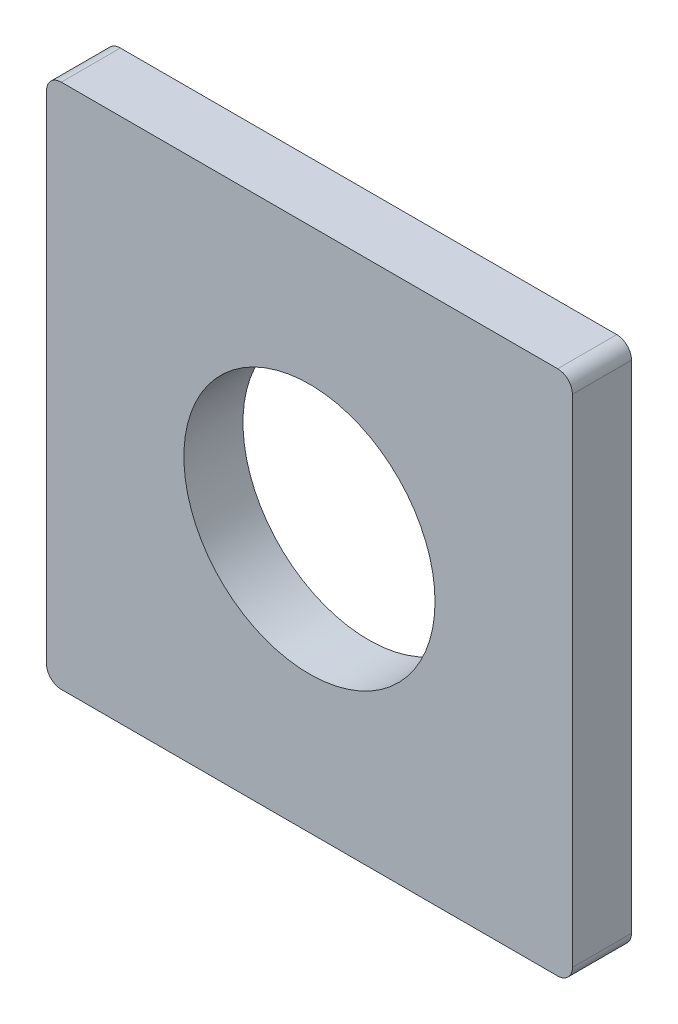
ISO-10303-21;
HEADER;
FILE_DESCRIPTION(('STEP AP214'),'2;1');
FILE_NAME('part.step','',(''),(''),'','','');
FILE_SCHEMA(('AUTOMOTIVE_DESIGN { 1 0 10303 214 1 1 1 1 }'));
ENDSEC;
DATA;
#1=APPLICATION_CONTEXT('core data for automotive mechanical design processes');
#2=APPLICATION_PROTOCOL_DEFINITION('international standard','automotive_design',2000,#1);
#3=PRODUCT_CONTEXT('',#1,'mechanical');
#4=PRODUCT('Part','Part','',(#3));
#5=PRODUCT_RELATED_PRODUCT_CATEGORY('part','',(#4));
#6=PRODUCT_DEFINITION_FORMATION('','',#4);
#7=PRODUCT_DEFINITION_CONTEXT('part definition',#1,'design');
#8=PRODUCT_DEFINITION('design','',#6,#7);
#9=PRODUCT_DEFINITION_SHAPE('','',#8);
#10=(LENGTH_UNIT() NAMED_UNIT(*) SI_UNIT(.MILLI.,.METRE.));
#11=(NAMED_UNIT(*) PLANE_ANGLE_UNIT() SI_UNIT($,.RADIAN.));
#12=(NAMED_UNIT(*) SI_UNIT($,.STERADIAN.) SOLID_ANGLE_UNIT());
#13=UNCERTAINTY_MEASURE_WITH_UNIT(LENGTH_MEASURE(1.E-05),#10,'distance_accuracy_value','');
#14=(GEOMETRIC_REPRESENTATION_CONTEXT(3) GLOBAL_UNCERTAINTY_ASSIGNED_CONTEXT((#13)) GLOBAL_UNIT_ASSIGNED_CONTEXT((#10,
#11,#12)) REPRESENTATION_CONTEXT('',''));
#15=CARTESIAN_POINT('',(0.,0.,0.));
#16=DIRECTION('',(0.,0.,1.));
#17=DIRECTION('',(1.,0.,0.));
#18=AXIS2_PLACEMENT_3D('',#15,#16,#17);
#19=CARTESIAN_POINT('',(0.5,0.5,2.));
#20=DIRECTION('',(0.,0.,1.));
#21=DIRECTION('',(1.,0.,0.));
#22=AXIS2_PLACEMENT_3D('',#19,#20,#21);
#23=PLANE('',#22);
#24=CARTESIAN_POINT('',(0.5,0.5,2.));
#25=DIRECTION('',(0.,0.,1.));
#26=DIRECTION('',(1.,0.,0.));
#27=AXIS2_PLACEMENT_3D('',#24,#25,#26);
#28=CIRCLE('',#27,0.5);
#29=CARTESIAN_POINT('',(0.,0.500000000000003,2.));
#30=VERTEX_POINT('',#29);
#31=CARTESIAN_POINT('',(0.500000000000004,0.,2.));
#32=VERTEX_POINT('',#31);
#33=EDGE_CURVE('E153',#30,#32,#28,.T.);
#34=ORIENTED_EDGE('',*,*,#33,.T.);
#35=DIRECTION('',(1.,0.,0.));
#36=VECTOR('',#35,1.);
#37=CARTESIAN_POINT('',(0.500000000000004,0.,2.));
#38=LINE('',#37,#36);
#39=CARTESIAN_POINT('',(17.3,0.,2.));
#40=VERTEX_POINT('',#39);
#41=EDGE_CURVE('E101',#32,#40,#38,.T.);
#42=ORIENTED_EDGE('',*,*,#41,.T.);
#43=CARTESIAN_POINT('',(17.3,0.5,2.));
#44=DIRECTION('',(0.,0.,1.));
#45=DIRECTION('',(1.,0.,0.));
#46=AXIS2_PLACEMENT_3D('',#43,#44,#45);
#47=CIRCLE('',#46,0.5);
#48=CARTESIAN_POINT('',(17.8,0.5,2.));
#49=VERTEX_POINT('',#48);
#50=EDGE_CURVE('E168',#40,#49,#47,.T.);
#51=ORIENTED_EDGE('',*,*,#50,.T.);
#52=DIRECTION('',(0.,1.,0.));
#53=VECTOR('',#52,1.);
#54=CARTESIAN_POINT('',(17.8,0.5,2.));
#55=LINE('',#54,#53);
#56=CARTESIAN_POINT('',(17.8,17.3,2.));
#57=VERTEX_POINT('',#56);
#58=EDGE_CURVE('E181',#49,#57,#55,.T.);
#59=ORIENTED_EDGE('',*,*,#58,.T.);
#60=CARTESIAN_POINT('',(17.3,17.3,2.));
#61=DIRECTION('',(0.,0.,1.));
#62=DIRECTION('',(1.,0.,0.));
#63=AXIS2_PLACEMENT_3D('',#60,#61,#62);
#64=CIRCLE('',#63,0.500000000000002);
#65=CARTESIAN_POINT('',(17.3,17.8,2.));
#66=VERTEX_POINT('',#65);
#67=EDGE_CURVE('E120',#57,#66,#64,.T.);
#68=ORIENTED_EDGE('',*,*,#67,.T.);
#69=DIRECTION('',(-1.,0.,0.));
#70=VECTOR('',#69,1.);
#71=CARTESIAN_POINT('',(0.5,17.8,2.));
#72=LINE('',#71,#70);
#73=CARTESIAN_POINT('',(0.5,17.8,2.));
#74=VERTEX_POINT('',#73);
#75=EDGE_CURVE('E114',#66,#74,#72,.T.);
#76=ORIENTED_EDGE('',*,*,#75,.T.);
#77=CARTESIAN_POINT('',(0.5,17.3,2.));
#78=DIRECTION('',(0.,0.,1.));
#79=DIRECTION('',(1.,0.,0.));
#80=AXIS2_PLACEMENT_3D('',#77,#78,#79);
#81=CIRCLE('',#80,0.5);
#82=CARTESIAN_POINT('',(0.,17.3,2.));
#83=VERTEX_POINT('',#82);
#84=EDGE_CURVE('E118',#74,#83,#81,.T.);
#85=ORIENTED_EDGE('',*,*,#84,.T.);
#86=DIRECTION('',(0.,-1.,0.));
#87=VECTOR('',#86,1.);
#88=CARTESIAN_POINT('',(0.,0.500000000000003,2.));
#89=LINE('',#88,#87);
#90=EDGE_CURVE('E58',#83,#30,#89,.T.);
#91=ORIENTED_EDGE('',*,*,#90,.T.);
#92=EDGE_LOOP('',(#34,#42,#51,#59,#68,#76,#85,#91));
#93=FACE_BOUND('',#92,.T.);
#94=CARTESIAN_POINT('',(8.9,8.9,2.));
#95=DIRECTION('',(0.,0.,1.));
#96=DIRECTION('',(1.,0.,0.));
#97=AXIS2_PLACEMENT_3D('',#94,#95,#96);
#98=CIRCLE('',#97,4.25);
#99=CARTESIAN_POINT('',(13.15,8.9,2.));
#100=VERTEX_POINT('',#99);
#101=EDGE_CURVE('E142',#100,#100,#98,.T.);
#102=ORIENTED_EDGE('',*,*,#101,.F.);
#103=EDGE_LOOP('',(#102));
#104=FACE_BOUND('',#103,.T.);
#105=ADVANCED_FACE('F41',(#93,#104),#23,.T.);
#106=CARTESIAN_POINT('',(0.5,0.5,0.));
#107=DIRECTION('',(0.,0.,1.));
#108=DIRECTION('',(1.,0.,0.));
#109=AXIS2_PLACEMENT_3D('',#106,#107,#108);
#110=PLANE('',#109);
#111=CARTESIAN_POINT('',(0.5,0.5,0.));
#112=DIRECTION('',(0.,0.,1.));
#113=DIRECTION('',(1.,0.,0.));
#114=AXIS2_PLACEMENT_3D('',#111,#112,#113);
#115=CIRCLE('',#114,0.5);
#116=CARTESIAN_POINT('',(0.,0.500000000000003,0.));
#117=VERTEX_POINT('',#116);
#118=CARTESIAN_POINT('',(0.500000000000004,0.,0.));
#119=VERTEX_POINT('',#118);
#120=EDGE_CURVE('E138',#117,#119,#115,.T.);
#121=ORIENTED_EDGE('',*,*,#120,.F.);
#122=DIRECTION('',(0.,-1.,0.));
#123=VECTOR('',#122,1.);
#124=CARTESIAN_POINT('',(0.,0.500000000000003,0.));
#125=LINE('',#124,#123);
#126=CARTESIAN_POINT('',(0.,17.3,0.));
#127=VERTEX_POINT('',#126);
#128=EDGE_CURVE('E93',#127,#117,#125,.T.);
#129=ORIENTED_EDGE('',*,*,#128,.F.);
#130=CARTESIAN_POINT('',(0.5,17.3,0.));
#131=DIRECTION('',(0.,0.,1.));
#132=DIRECTION('',(1.,0.,0.));
#133=AXIS2_PLACEMENT_3D('',#130,#131,#132);
#134=CIRCLE('',#133,0.5);
#135=CARTESIAN_POINT('',(0.5,17.8,0.));
#136=VERTEX_POINT('',#135);
#137=EDGE_CURVE('E87',#136,#127,#134,.T.);
#138=ORIENTED_EDGE('',*,*,#137,.F.);
#139=DIRECTION('',(-1.,0.,0.));
#140=VECTOR('',#139,1.);
#141=CARTESIAN_POINT('',(0.5,17.8,0.));
#142=LINE('',#141,#140);
#143=CARTESIAN_POINT('',(17.3,17.8,0.));
#144=VERTEX_POINT('',#143);
#145=EDGE_CURVE('E128',#144,#136,#142,.T.);
#146=ORIENTED_EDGE('',*,*,#145,.F.);
#147=CARTESIAN_POINT('',(17.3,17.3,0.));
#148=DIRECTION('',(0.,0.,1.));
#149=DIRECTION('',(1.,0.,0.));
#150=AXIS2_PLACEMENT_3D('',#147,#148,#149);
#151=CIRCLE('',#150,0.500000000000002);
#152=CARTESIAN_POINT('',(17.8,17.3,0.));
#153=VERTEX_POINT('',#152);
#154=EDGE_CURVE('E148',#153,#144,#151,.T.);
#155=ORIENTED_EDGE('',*,*,#154,.F.);
#156=DIRECTION('',(0.,1.,0.));
#157=VECTOR('',#156,1.);
#158=CARTESIAN_POINT('',(17.8,0.5,0.));
#159=LINE('',#158,#157);
#160=CARTESIAN_POINT('',(17.8,0.5,0.));
#161=VERTEX_POINT('',#160);
#162=EDGE_CURVE('E146',#161,#153,#159,.T.);
#163=ORIENTED_EDGE('',*,*,#162,.F.);
#164=CARTESIAN_POINT('',(17.3,0.5,0.));
#165=DIRECTION('',(0.,0.,1.));
#166=DIRECTION('',(1.,0.,0.));
#167=AXIS2_PLACEMENT_3D('',#164,#165,#166);
#168=CIRCLE('',#167,0.5);
#169=CARTESIAN_POINT('',(17.3,0.,0.));
#170=VERTEX_POINT('',#169);
#171=EDGE_CURVE('E144',#170,#161,#168,.T.);
#172=ORIENTED_EDGE('',*,*,#171,.F.);
#173=DIRECTION('',(1.,0.,0.));
#174=VECTOR('',#173,1.);
#175=CARTESIAN_POINT('',(0.500000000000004,0.,0.));
#176=LINE('',#175,#174);
#177=EDGE_CURVE('E141',#119,#170,#176,.T.);
#178=ORIENTED_EDGE('',*,*,#177,.F.);
#179=EDGE_LOOP('',(#121,#129,#138,#146,#155,#163,#172,#178));
#180=FACE_BOUND('',#179,.T.);
#181=CARTESIAN_POINT('',(8.9,8.9,0.));
#182=DIRECTION('',(0.,0.,1.));
#183=DIRECTION('',(1.,0.,0.));
#184=AXIS2_PLACEMENT_3D('',#181,#182,#183);
#185=CIRCLE('',#184,4.25);
#186=CARTESIAN_POINT('',(13.15,8.9,0.));
#187=VERTEX_POINT('',#186);
#188=EDGE_CURVE('E187',#187,#187,#185,.T.);
#189=ORIENTED_EDGE('',*,*,#188,.T.);
#190=EDGE_LOOP('',(#189));
#191=FACE_BOUND('',#190,.T.);
#192=ADVANCED_FACE('F172',(#180,#191),#110,.F.);
#193=CARTESIAN_POINT('',(0.5,0.5,2.));
#194=DIRECTION('',(0.,0.,-1.));
#195=DIRECTION('',(-1.,0.,0.));
#196=AXIS2_PLACEMENT_3D('',#193,#194,#195);
#197=CYLINDRICAL_SURFACE('',#196,0.5);
#198=ORIENTED_EDGE('',*,*,#120,.T.);
#199=DIRECTION('',(0.,0.,-1.));
#200=VECTOR('',#199,1.);
#201=CARTESIAN_POINT('',(0.500000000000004,0.,2.));
#202=LINE('',#201,#200);
#203=EDGE_CURVE('E11',#32,#119,#202,.T.);
#204=ORIENTED_EDGE('',*,*,#203,.F.);
#205=ORIENTED_EDGE('',*,*,#33,.F.);
#206=DIRECTION('',(0.,0.,-1.));
#207=VECTOR('',#206,1.);
#208=CARTESIAN_POINT('',(0.,0.500000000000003,2.));
#209=LINE('',#208,#207);
#210=EDGE_CURVE('E134',#30,#117,#209,.T.);
#211=ORIENTED_EDGE('',*,*,#210,.T.);
#212=EDGE_LOOP('',(#198,#204,#205,#211));
#213=FACE_BOUND('',#212,.T.);
#214=ADVANCED_FACE('F43',(#213),#197,.T.);
#215=CARTESIAN_POINT('',(0.500000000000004,0.,2.));
#216=DIRECTION('',(0.,1.,0.));
#217=DIRECTION('',(0.,0.,1.));
#218=AXIS2_PLACEMENT_3D('',#215,#216,#217);
#219=PLANE('',#218);
#220=ORIENTED_EDGE('',*,*,#177,.T.);
#221=DIRECTION('',(0.,0.,-1.));
#222=VECTOR('',#221,1.);
#223=CARTESIAN_POINT('',(17.3,0.,2.));
#224=LINE('',#223,#222);
#225=EDGE_CURVE('E50',#40,#170,#224,.T.);
#226=ORIENTED_EDGE('',*,*,#225,.F.);
#227=ORIENTED_EDGE('',*,*,#41,.F.);
#228=ORIENTED_EDGE('',*,*,#203,.T.);
#229=EDGE_LOOP('',(#220,#226,#227,#228));
#230=FACE_BOUND('',#229,.T.);
#231=ADVANCED_FACE('F215',(#230),#219,.F.);
#232=CARTESIAN_POINT('',(17.3,0.5,2.));
#233=DIRECTION('',(0.,0.,-1.));
#234=DIRECTION('',(-1.,0.,0.));
#235=AXIS2_PLACEMENT_3D('',#232,#233,#234);
#236=CYLINDRICAL_SURFACE('',#235,0.5);
#237=ORIENTED_EDGE('',*,*,#171,.T.);
#238=DIRECTION('',(0.,0.,-1.));
#239=VECTOR('',#238,1.);
#240=CARTESIAN_POINT('',(17.8,0.5,2.));
#241=LINE('',#240,#239);
#242=EDGE_CURVE('E160',#49,#161,#241,.T.);
#243=ORIENTED_EDGE('',*,*,#242,.F.);
#244=ORIENTED_EDGE('',*,*,#50,.F.);
#245=ORIENTED_EDGE('',*,*,#225,.T.);
#246=EDGE_LOOP('',(#237,#243,#244,#245));
#247=FACE_BOUND('',#246,.T.);
#248=ADVANCED_FACE('F166',(#247),#236,.T.);
#249=CARTESIAN_POINT('',(17.8,0.5,2.));
#250=DIRECTION('',(-1.,0.,0.));
#251=DIRECTION('',(0.,0.,1.));
#252=AXIS2_PLACEMENT_3D('',#249,#250,#251);
#253=PLANE('',#252);
#254=ORIENTED_EDGE('',*,*,#162,.T.);
#255=DIRECTION('',(0.,0.,-1.));
#256=VECTOR('',#255,1.);
#257=CARTESIAN_POINT('',(17.8,17.3,2.));
#258=LINE('',#257,#256);
#259=EDGE_CURVE('E157',#57,#153,#258,.T.);
#260=ORIENTED_EDGE('',*,*,#259,.F.);
#261=ORIENTED_EDGE('',*,*,#58,.F.);
#262=ORIENTED_EDGE('',*,*,#242,.T.);
#263=EDGE_LOOP('',(#254,#260,#261,#262));
#264=FACE_BOUND('',#263,.T.);
#265=ADVANCED_FACE('F177',(#264),#253,.F.);
#266=CARTESIAN_POINT('',(17.3,17.3,2.));
#267=DIRECTION('',(0.,0.,-1.));
#268=DIRECTION('',(-1.,0.,0.));
#269=AXIS2_PLACEMENT_3D('',#266,#267,#268);
#270=CYLINDRICAL_SURFACE('',#269,0.500000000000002);
#271=ORIENTED_EDGE('',*,*,#154,.T.);
#272=DIRECTION('',(0.,0.,-1.));
#273=VECTOR('',#272,1.);
#274=CARTESIAN_POINT('',(17.3,17.8,2.));
#275=LINE('',#274,#273);
#276=EDGE_CURVE('E129',#66,#144,#275,.T.);
#277=ORIENTED_EDGE('',*,*,#276,.F.);
#278=ORIENTED_EDGE('',*,*,#67,.F.);
#279=ORIENTED_EDGE('',*,*,#259,.T.);
#280=EDGE_LOOP('',(#271,#277,#278,#279));
#281=FACE_BOUND('',#280,.T.);
#282=ADVANCED_FACE('F180',(#281),#270,.T.);
#283=CARTESIAN_POINT('',(0.5,17.8,2.));
#284=DIRECTION('',(0.,-1.,0.));
#285=DIRECTION('',(0.,0.,-1.));
#286=AXIS2_PLACEMENT_3D('',#283,#284,#285);
#287=PLANE('',#286);
#288=ORIENTED_EDGE('',*,*,#145,.T.);
#289=DIRECTION('',(0.,0.,-1.));
#290=VECTOR('',#289,1.);
#291=CARTESIAN_POINT('',(0.5,17.8,2.));
#292=LINE('',#291,#290);
#293=EDGE_CURVE('E125',#74,#136,#292,.T.);
#294=ORIENTED_EDGE('',*,*,#293,.F.);
#295=ORIENTED_EDGE('',*,*,#75,.F.);
#296=ORIENTED_EDGE('',*,*,#276,.T.);
#297=EDGE_LOOP('',(#288,#294,#295,#296));
#298=FACE_BOUND('',#297,.T.);
#299=ADVANCED_FACE('F126',(#298),#287,.F.);
#300=CARTESIAN_POINT('',(0.5,17.3,2.));
#301=DIRECTION('',(0.,0.,-1.));
#302=DIRECTION('',(-1.,0.,0.));
#303=AXIS2_PLACEMENT_3D('',#300,#301,#302);
#304=CYLINDRICAL_SURFACE('',#303,0.5);
#305=ORIENTED_EDGE('',*,*,#137,.T.);
#306=DIRECTION('',(0.,0.,-1.));
#307=VECTOR('',#306,1.);
#308=CARTESIAN_POINT('',(0.,17.3,2.));
#309=LINE('',#308,#307);
#310=EDGE_CURVE('E130',#83,#127,#309,.T.);
#311=ORIENTED_EDGE('',*,*,#310,.F.);
#312=ORIENTED_EDGE('',*,*,#84,.F.);
#313=ORIENTED_EDGE('',*,*,#293,.T.);
#314=EDGE_LOOP('',(#305,#311,#312,#313));
#315=FACE_BOUND('',#314,.T.);
#316=ADVANCED_FACE('F132',(#315),#304,.T.);
#317=CARTESIAN_POINT('',(0.,0.500000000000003,2.));
#318=DIRECTION('',(1.,0.,0.));
#319=DIRECTION('',(0.,0.,-1.));
#320=AXIS2_PLACEMENT_3D('',#317,#318,#319);
#321=PLANE('',#320);
#322=ORIENTED_EDGE('',*,*,#128,.T.);
#323=ORIENTED_EDGE('',*,*,#210,.F.);
#324=ORIENTED_EDGE('',*,*,#90,.F.);
#325=ORIENTED_EDGE('',*,*,#310,.T.);
#326=EDGE_LOOP('',(#322,#323,#324,#325));
#327=FACE_BOUND('',#326,.T.);
#328=ADVANCED_FACE('F203',(#327),#321,.F.);
#329=CARTESIAN_POINT('',(8.9,8.9,2.));
#330=DIRECTION('',(0.,0.,-1.));
#331=DIRECTION('',(-1.,0.,0.));
#332=AXIS2_PLACEMENT_3D('',#329,#330,#331);
#333=CYLINDRICAL_SURFACE('',#332,4.25);
#334=ORIENTED_EDGE('',*,*,#101,.T.);
#335=EDGE_LOOP('',(#334));
#336=FACE_BOUND('',#335,.T.);
#337=ORIENTED_EDGE('',*,*,#188,.F.);
#338=EDGE_LOOP('',(#337));
#339=FACE_BOUND('',#338,.T.);
#340=ADVANCED_FACE('F193',(#336,#339),#333,.F.);
#341=CLOSED_SHELL('',(#105,#192,#214,#231,#248,#265,#282,#299,#316,#328,#340));
#342=MANIFOLD_SOLID_BREP('B2',#341);
#343=ADVANCED_BREP_SHAPE_REPRESENTATION('',(#18,#342),#14);
#344=SHAPE_DEFINITION_REPRESENTATION(#9,#343);
ENDSEC;
END-ISO-10303-21;
